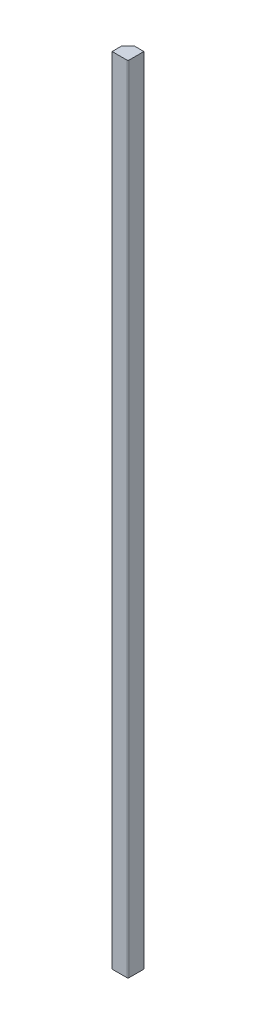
from build123d import *

# Parameters (mm, degrees)
EXTRUDE_L_NGD_DEPTH = 2500
FILLET_KANTER_R     = 3


with BuildPart() as part:
    # Sketch3 → Extrude l_ngd (new body)
    with BuildSketch(Plane(origin=(0, 0, 0), x_dir=(1, 0, 0), z_dir=(0, 1, 0))):
        Polygon((0, -50), (50, -50), (50, 0), (20, 0), (0, -20), align=None)
    extrude(amount=EXTRUDE_L_NGD_DEPTH)

    # Fillet kanter
    fillet_kanter_edges = [part.edges().sort_by_distance(p)[0] for p in [
        (50, 1250, 50),
    ]]
    fillet(fillet_kanter_edges, radius=FILLET_KANTER_R)


solid = part.part
